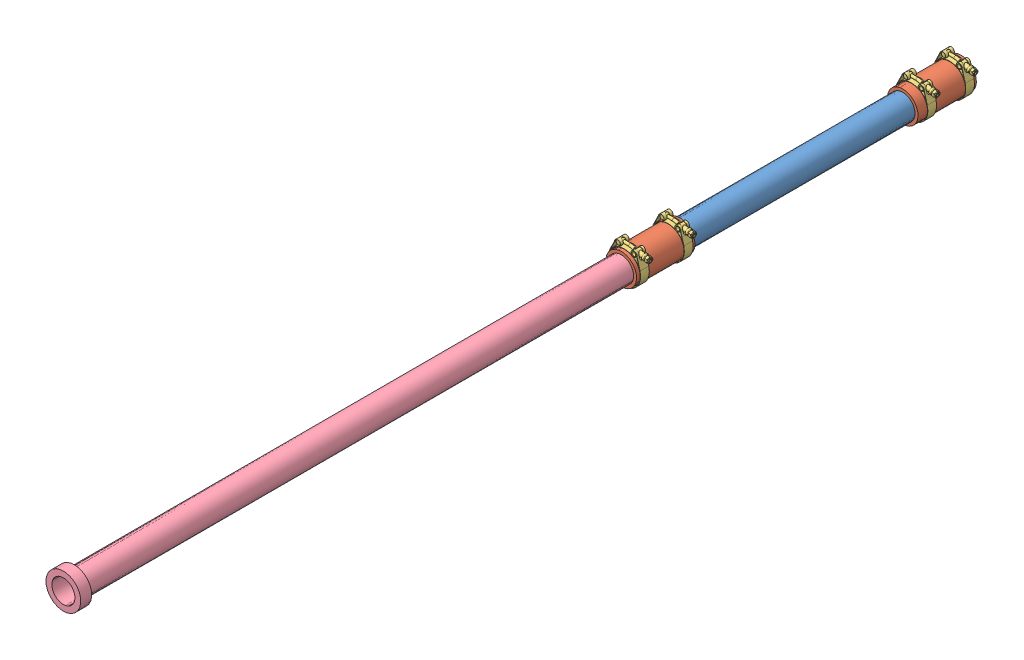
SolidWorks assembly Snoot Tube Assembly FDL 1.SLDASM, configuration Default (file format 13000). Lengths in mm.
Overall size (97.91 97.2 1952.63).
8 component instances, 4 part files, 17 mates.
Components (placement in the parent):
- Intermediate Removable Pipe (23.6in)-1: Intermediate Removable Pipe (23.6in).SLDPRT [Default] at (208.3222 296.1958 179.8398) size (53.98 53.98 599.44)
- Rubber Hose (5in)-1: Rubber Hose (5in).SLDPRT [Default] at (208.3222 296.1958 722.1298) x (-0.942512 0.334174 0) z (0 0 1) size (66.67 66.67 127)
- Rubber Hose (5in)-2: Rubber Hose (5in).SLDPRT [Default] at (208.3222 296.1958 109.9898) x (-0.901788 -0.43218 0) z (0 0 1) size (66.67 66.67 127)
- 5312K657_Tight-Seal Stainless Steel Bolt Clamp for Soft Hose and Tube-1: 5312K657_Tight-Seal Stainless Steel Bolt Clamp for Soft Hose and Tube.SLDPRT [5312K657] at (208.3222 296.1958 833.2548) x (0.996194 -0.087161 0) z (0 0 1) size (81.25 79.12 19.05)
- 5312K657_Tight-Seal Stainless Steel Bolt Clamp for Soft Hose and Tube-2: 5312K657_Tight-Seal Stainless Steel Bolt Clamp for Soft Hose and Tube.SLDPRT [5312K657] at (208.3222 296.1958 738.0048) x (0.996194 -0.087161 0) z (0 0 1) size (81.25 79.12 19.05)
- 5312K657_Tight-Seal Stainless Steel Bolt Clamp for Soft Hose and Tube-3: 5312K657_Tight-Seal Stainless Steel Bolt Clamp for Soft Hose and Tube.SLDPRT [5312K657] at (208.3222 296.1958 208.4148) x (0.996194 -0.087161 0) z (0 0 1) size (81.25 79.12 19.05)
- 5312K657_Tight-Seal Stainless Steel Bolt Clamp for Soft Hose and Tube-4: 5312K657_Tight-Seal Stainless Steel Bolt Clamp for Soft Hose and Tube.SLDPRT [5312K657] at (208.3222 296.1958 125.8648) x (0.996194 -0.087161 0) z (0 0 1) size (81.25 79.12 19.05)
- Snoot With Window FDL 1-1: Snoot With Window FDL 1.SLDPRT [Default] at (208.3222 296.1958 791.9798) x (0.93951 -0.342521 0) z (0 0 1) size (75.82 75.82 1270.63)
Mates (geometry in assembly coordinates):
- Concentric1: concentric anti-aligned: cylinder of Intermediate Removable Pipe (23.6in)-1 through (208.3222 296.1958 779.2798) axis (0 0 -1) radius 26.9875; circle of Rubber Hose (5in)-1
- Concentric2: concentric aligned: cylinder of Intermediate Removable Pipe (23.6in)-1 through (208.3222 296.1958 779.2798) axis (0 0 -1) radius 26.9875; cylinder of Rubber Hose (5in)-2 through (208.3222 296.1958 236.9898) axis (0 0 -1) radius 26.9875
- Concentric3: concentric aligned: cylinder of Rubber Hose (5in)-1 through (208.3222 296.1958 849.1298) axis (0 0 -1) radius 33.3375; cylinder of 5312K657_Tight-Seal Stainless Steel Bolt Clamp for Soft Hose and Tube-1 through (208.3222 296.1958 842.7798) axis (0 0 -1) radius 34.925
- Concentric4: concentric aligned: cylinder of Rubber Hose (5in)-1 through (208.3222 296.1958 849.1298) axis (0 0 -1) radius 33.3375; cylinder of 5312K657_Tight-Seal Stainless Steel Bolt Clamp for Soft Hose and Tube-2 through (208.3222 296.1958 747.5298) axis (0 0 -1) radius 34.29
- Concentric5: concentric aligned: cylinder of Rubber Hose (5in)-2 through (208.3222 296.1958 236.9898) axis (0 0 -1) radius 33.3375; cylinder of 5312K657_Tight-Seal Stainless Steel Bolt Clamp for Soft Hose and Tube-3 through (208.3222 296.1958 217.9398) axis (0 0 -1) radius 34.29
- Concentric6: concentric aligned: cylinder of Rubber Hose (5in)-2 through (208.3222 296.1958 236.9898) axis (0 0 -1) radius 33.3375; cylinder of 5312K657_Tight-Seal Stainless Steel Bolt Clamp for Soft Hose and Tube-4 through (208.3222 296.1958 135.3898) axis (0 0 -1) radius 34.29
- Parallel1: parallel aligned: plane of 5312K657_Tight-Seal Stainless Steel Bolt Clamp for Soft Hose and Tube-1 through (255.9745 327.2557 833.2548) normal (0.986293 -0.165001 0); plane of 5312K657_Tight-Seal Stainless Steel Bolt Clamp for Soft Hose and Tube-2 through (255.9745 327.2557 738.0048) normal (0.986293 -0.165001 0)
- Parallel2: parallel aligned: plane of 5312K657_Tight-Seal Stainless Steel Bolt Clamp for Soft Hose and Tube-3 through (255.9745 327.2557 208.4148) normal (0.986293 -0.165001 0); plane of 5312K657_Tight-Seal Stainless Steel Bolt Clamp for Soft Hose and Tube-4 through (255.9745 327.2557 125.8648) normal (0.986293 -0.165001 0)
- Distance2: distance = 63.5 mm anti-aligned: plane of 5312K657_Tight-Seal Stainless Steel Bolt Clamp for Soft Hose and Tube-3 through (193.7741 334.8219 198.8898) normal (0 0 -1); plane of 5312K657_Tight-Seal Stainless Steel Bolt Clamp for Soft Hose and Tube-4 through (194.1278 337.6023 135.3898) normal (0 0 1)
- Distance3: distance = 76.2 mm anti-aligned: plane of 5312K657_Tight-Seal Stainless Steel Bolt Clamp for Soft Hose and Tube-2 through (193.7741 334.8219 747.5298) normal (0 0 1); plane of 5312K657_Tight-Seal Stainless Steel Bolt Clamp for Soft Hose and Tube-1 through (193.7741 334.8219 823.7298) normal (0 0 -1)
- Distance4: distance = 6.35 mm aligned: plane of Rubber Hose (5in)-1 through (208.3222 296.1958 849.1298) normal (0 0 1); plane of 5312K657_Tight-Seal Stainless Steel Bolt Clamp for Soft Hose and Tube-1 through (208.3222 296.1958 842.7798) normal (0 0 1)
- Distance5: distance = 6.35 mm aligned: plane of Rubber Hose (5in)-2 through (208.3222 296.1958 109.9898) normal (0 0 -1); plane of 5312K657_Tight-Seal Stainless Steel Bolt Clamp for Soft Hose and Tube-4 through (208.3222 296.1958 116.3398) normal (0 0 -1)
- LimitDistance1: limit distance = 57.15 mm anti-aligned: plane of Intermediate Removable Pipe (23.6in)-1 through (208.3222 296.1958 779.2798) normal (0 0 1); plane of Rubber Hose (5in)-1 through (208.3222 296.1958 722.1298) normal (0 0 -1)
- LimitDistance2: limit distance = 57.15 mm anti-aligned: plane of Intermediate Removable Pipe (23.6in)-1 through (208.3222 296.1958 179.8398) normal (0 0 -1); plane of Rubber Hose (5in)-2 through (208.3222 296.1958 236.9898) normal (0 0 1)
- Parallel4: parallel aligned: plane of 5312K657_Tight-Seal Stainless Steel Bolt Clamp for Soft Hose and Tube-2 through (255.9745 327.2557 738.0048) normal (0.986293 -0.165001 0); plane of 5312K657_Tight-Seal Stainless Steel Bolt Clamp for Soft Hose and Tube-3 through (255.9745 327.2557 208.4148) normal (0.986293 -0.165001 0)
- Concentric7: concentric aligned: cylinder of Rubber Hose (5in)-1 through (208.3222 296.1958 849.1298) axis (0 0 -1) radius 26.9875; cylinder of Snoot With Window FDL 1-1 through (208.3222 296.1958 2062.6148) axis (0 0 -1) radius 26.9875
- Distance8: distance = 12.7 mm anti-aligned: plane of Intermediate Removable Pipe (23.6in)-1 through (208.3222 296.1958 779.2798) normal (0 0 1); plane of Snoot With Window FDL 1-1 through (208.3222 296.1958 791.9798) normal (0 0 -1)
